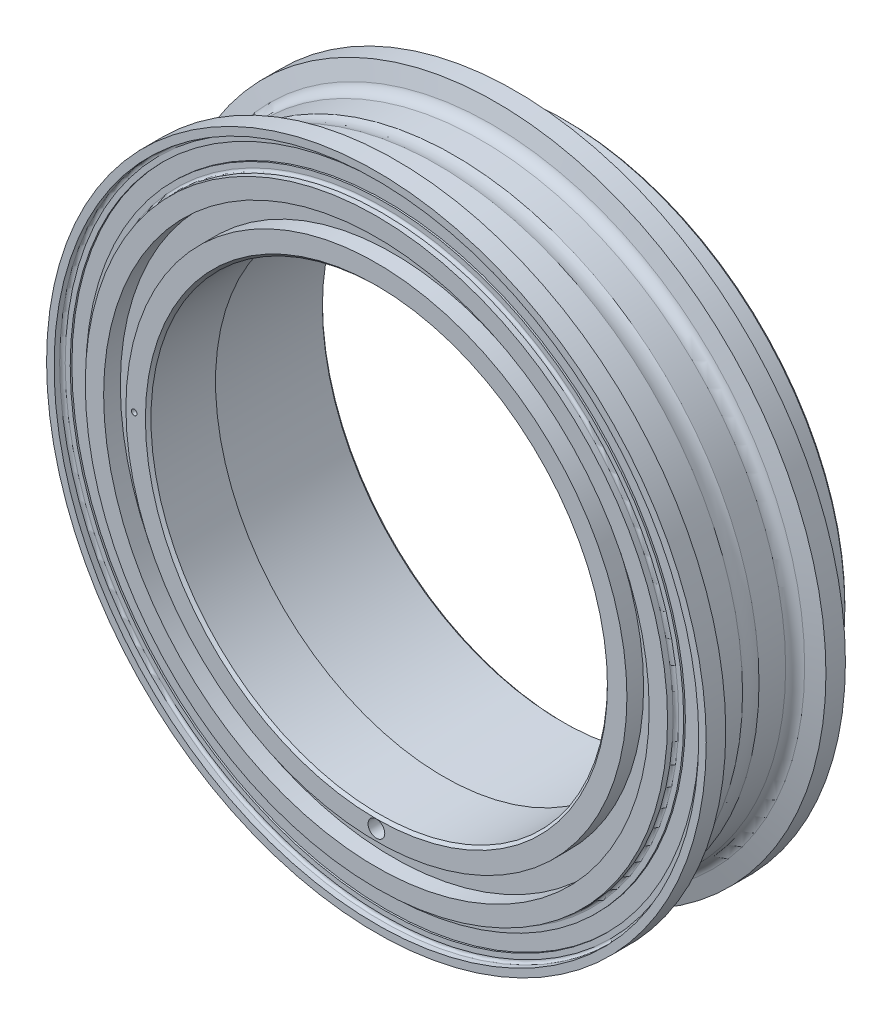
ISO-10303-21;
HEADER;
FILE_DESCRIPTION(('STEP AP214'),'2;1');
FILE_NAME('part.step','',(''),(''),'','','');
FILE_SCHEMA(('AUTOMOTIVE_DESIGN { 1 0 10303 214 1 1 1 1 }'));
ENDSEC;
DATA;
#1=APPLICATION_CONTEXT('core data for automotive mechanical design processes');
#2=APPLICATION_PROTOCOL_DEFINITION('international standard','automotive_design',2000,#1);
#3=PRODUCT_CONTEXT('',#1,'mechanical');
#4=PRODUCT('Part','Part','',(#3));
#5=PRODUCT_RELATED_PRODUCT_CATEGORY('part','',(#4));
#6=PRODUCT_DEFINITION_FORMATION('','',#4);
#7=PRODUCT_DEFINITION_CONTEXT('part definition',#1,'design');
#8=PRODUCT_DEFINITION('design','',#6,#7);
#9=PRODUCT_DEFINITION_SHAPE('','',#8);
#10=(LENGTH_UNIT() NAMED_UNIT(*) SI_UNIT(.MILLI.,.METRE.));
#11=(NAMED_UNIT(*) PLANE_ANGLE_UNIT() SI_UNIT($,.RADIAN.));
#12=(NAMED_UNIT(*) SI_UNIT($,.STERADIAN.) SOLID_ANGLE_UNIT());
#13=UNCERTAINTY_MEASURE_WITH_UNIT(LENGTH_MEASURE(1.E-05),#10,'distance_accuracy_value','');
#14=(GEOMETRIC_REPRESENTATION_CONTEXT(3) GLOBAL_UNCERTAINTY_ASSIGNED_CONTEXT((#13)) GLOBAL_UNIT_ASSIGNED_CONTEXT((#10,
#11,#12)) REPRESENTATION_CONTEXT('',''));
#15=CARTESIAN_POINT('',(0.,0.,0.));
#16=DIRECTION('',(0.,0.,1.));
#17=DIRECTION('',(1.,0.,0.));
#18=AXIS2_PLACEMENT_3D('',#15,#16,#17);
#19=CARTESIAN_POINT('',(-43.5,0.,-4.51545182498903));
#20=DIRECTION('',(0.,0.,1.));
#21=DIRECTION('',(1.,0.,0.));
#22=AXIS2_PLACEMENT_3D('',#19,#20,#21);
#23=CYLINDRICAL_SURFACE('',#22,0.5);
#24=CARTESIAN_POINT('',(-43.5,0.,-4.));
#25=DIRECTION('',(0.,0.,1.));
#26=DIRECTION('',(1.,0.,0.));
#27=AXIS2_PLACEMENT_3D('',#24,#25,#26);
#28=CIRCLE('',#27,0.5);
#29=CARTESIAN_POINT('',(-43.,0.,-4.));
#30=VERTEX_POINT('',#29);
#31=EDGE_CURVE('E207',#30,#30,#28,.T.);
#32=ORIENTED_EDGE('',*,*,#31,.F.);
#33=EDGE_LOOP('',(#32));
#34=FACE_BOUND('',#33,.T.);
#35=CARTESIAN_POINT('',(-43.5,0.,0.));
#36=DIRECTION('',(0.,0.,1.));
#37=DIRECTION('',(1.,0.,0.));
#38=AXIS2_PLACEMENT_3D('',#35,#36,#37);
#39=CIRCLE('',#38,0.5);
#40=CARTESIAN_POINT('',(-43.,0.,0.));
#41=VERTEX_POINT('',#40);
#42=EDGE_CURVE('E20',#41,#41,#39,.T.);
#43=ORIENTED_EDGE('',*,*,#42,.T.);
#44=EDGE_LOOP('',(#43));
#45=FACE_BOUND('',#44,.T.);
#46=ADVANCED_FACE('F16',(#34,#45),#23,.F.);
#47=CARTESIAN_POINT('',(-43.5,0.,-3.99999999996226));
#48=DIRECTION('',(0.,0.,1.));
#49=DIRECTION('',(1.,0.,0.));
#50=AXIS2_PLACEMENT_3D('',#47,#48,#49);
#51=CONICAL_SURFACE('',#50,0.500000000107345,1.02974425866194);
#52=CARTESIAN_POINT('',(-43.4999999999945,0.,-4.3004303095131));
#53=VERTEX_POINT('',#52);
#54=VERTEX_LOOP('',#53);
#55=FACE_BOUND('',#54,.T.);
#56=ORIENTED_EDGE('',*,*,#31,.T.);
#57=EDGE_LOOP('',(#56));
#58=FACE_BOUND('',#57,.T.);
#59=ADVANCED_FACE('F18',(#55,#58),#51,.F.);
#60=CARTESIAN_POINT('',(0.,-43.,-6.196355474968));
#61=DIRECTION('',(0.,0.,1.));
#62=DIRECTION('',(1.,0.,0.));
#63=AXIS2_PLACEMENT_3D('',#60,#61,#62);
#64=CYLINDRICAL_SURFACE('',#63,1.5);
#65=CARTESIAN_POINT('',(0.,-43.,-5.));
#66=DIRECTION('',(0.,0.,1.));
#67=DIRECTION('',(1.,0.,0.));
#68=AXIS2_PLACEMENT_3D('',#65,#66,#67);
#69=CIRCLE('',#68,1.5);
#70=CARTESIAN_POINT('',(1.49999999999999,-43.,-5.));
#71=VERTEX_POINT('',#70);
#72=EDGE_CURVE('E203',#71,#71,#69,.T.);
#73=ORIENTED_EDGE('',*,*,#72,.F.);
#74=EDGE_LOOP('',(#73));
#75=FACE_BOUND('',#74,.T.);
#76=CARTESIAN_POINT('',(0.,-43.,0.));
#77=DIRECTION('',(0.,0.,1.));
#78=DIRECTION('',(1.,0.,0.));
#79=AXIS2_PLACEMENT_3D('',#76,#77,#78);
#80=CIRCLE('',#79,1.5);
#81=CARTESIAN_POINT('',(0.,-41.5,0.));
#82=VERTEX_POINT('',#81);
#83=EDGE_CURVE('E25',#82,#82,#80,.T.);
#84=ORIENTED_EDGE('',*,*,#83,.T.);
#85=EDGE_LOOP('',(#84));
#86=FACE_BOUND('',#85,.T.);
#87=ADVANCED_FACE('F219',(#75,#86),#64,.F.);
#88=CARTESIAN_POINT('',(0.,-43.,-4.99999999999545));
#89=DIRECTION('',(0.,0.,1.));
#90=DIRECTION('',(1.,0.,0.));
#91=AXIS2_PLACEMENT_3D('',#88,#89,#90);
#92=CONICAL_SURFACE('',#91,1.4999999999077,1.02974425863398);
#93=CARTESIAN_POINT('',(0.,-43.,-5.90129092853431));
#94=VERTEX_POINT('',#93);
#95=VERTEX_LOOP('',#94);
#96=FACE_BOUND('',#95,.T.);
#97=ORIENTED_EDGE('',*,*,#72,.T.);
#98=EDGE_LOOP('',(#97));
#99=FACE_BOUND('',#98,.T.);
#100=ADVANCED_FACE('F238',(#96,#99),#92,.F.);
#101=CARTESIAN_POINT('',(0.,0.,0.));
#102=DIRECTION('',(0.,0.,1.));
#103=DIRECTION('',(1.,0.,0.));
#104=AXIS2_PLACEMENT_3D('',#101,#102,#103);
#105=CONICAL_SURFACE('',#104,41.5,0.785398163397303);
#106=CARTESIAN_POINT('',(0.,0.,0.));
#107=DIRECTION('',(0.,0.,1.));
#108=DIRECTION('',(1.,0.,0.));
#109=AXIS2_PLACEMENT_3D('',#106,#107,#108);
#110=CIRCLE('',#109,41.5);
#111=EDGE_CURVE('E211',#82,#82,#110,.T.);
#112=ORIENTED_EDGE('',*,*,#111,.T.);
#113=EDGE_LOOP('',(#112));
#114=FACE_BOUND('',#113,.T.);
#115=CARTESIAN_POINT('',(0.,0.,-0.500000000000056));
#116=DIRECTION('',(0.,0.,1.));
#117=DIRECTION('',(1.,0.,0.));
#118=AXIS2_PLACEMENT_3D('',#115,#116,#117);
#119=CIRCLE('',#118,41.);
#120=CARTESIAN_POINT('',(41.,0.,-0.500000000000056));
#121=VERTEX_POINT('',#120);
#122=EDGE_CURVE('E206',#121,#121,#119,.F.);
#123=ORIENTED_EDGE('',*,*,#122,.T.);
#124=EDGE_LOOP('',(#123));
#125=FACE_BOUND('',#124,.T.);
#126=ADVANCED_FACE('F214',(#114,#125),#105,.F.);
#127=CARTESIAN_POINT('',(0.,0.,-35.595));
#128=DIRECTION('',(0.,0.,1.));
#129=DIRECTION('',(1.,0.,0.));
#130=AXIS2_PLACEMENT_3D('',#127,#128,#129);
#131=CYLINDRICAL_SURFACE('',#130,41.);
#132=ORIENTED_EDGE('',*,*,#122,.F.);
#133=EDGE_LOOP('',(#132));
#134=FACE_BOUND('',#133,.T.);
#135=CARTESIAN_POINT('',(0.,0.,-12.1));
#136=DIRECTION('',(0.,0.,1.));
#137=DIRECTION('',(1.,0.,0.));
#138=AXIS2_PLACEMENT_3D('',#135,#136,#137);
#139=CIRCLE('',#138,41.);
#140=CARTESIAN_POINT('',(41.,0.,-12.1));
#141=VERTEX_POINT('',#140);
#142=EDGE_CURVE('E536',#141,#141,#139,.F.);
#143=ORIENTED_EDGE('',*,*,#142,.T.);
#144=EDGE_LOOP('',(#143));
#145=FACE_BOUND('',#144,.T.);
#146=ADVANCED_FACE('F237',(#134,#145),#131,.F.);
#147=CARTESIAN_POINT('',(0.,0.,-12.1));
#148=DIRECTION('',(0.,0.,1.));
#149=DIRECTION('',(1.,0.,0.));
#150=AXIS2_PLACEMENT_3D('',#147,#148,#149);
#151=PLANE('',#150);
#152=CARTESIAN_POINT('',(0.,0.,-12.1));
#153=DIRECTION('',(0.,0.,1.));
#154=DIRECTION('',(1.,0.,0.));
#155=AXIS2_PLACEMENT_3D('',#152,#153,#154);
#156=CIRCLE('',#155,43.1);
#157=CARTESIAN_POINT('',(43.1,0.,-12.1));
#158=VERTEX_POINT('',#157);
#159=EDGE_CURVE('E539',#158,#158,#156,.F.);
#160=ORIENTED_EDGE('',*,*,#159,.T.);
#161=EDGE_LOOP('',(#160));
#162=FACE_BOUND('',#161,.T.);
#163=ORIENTED_EDGE('',*,*,#142,.F.);
#164=EDGE_LOOP('',(#163));
#165=FACE_BOUND('',#164,.T.);
#166=ADVANCED_FACE('F241',(#162,#165),#151,.F.);
#167=CARTESIAN_POINT('',(0.,0.,-35.595));
#168=DIRECTION('',(0.,0.,1.));
#169=DIRECTION('',(1.,0.,0.));
#170=AXIS2_PLACEMENT_3D('',#167,#168,#169);
#171=CYLINDRICAL_SURFACE('',#170,43.1);
#172=CARTESIAN_POINT('',(0.,0.,-33.4));
#173=DIRECTION('',(0.,0.,1.));
#174=DIRECTION('',(1.,0.,0.));
#175=AXIS2_PLACEMENT_3D('',#172,#173,#174);
#176=CIRCLE('',#175,43.1);
#177=CARTESIAN_POINT('',(43.1,0.,-33.4));
#178=VERTEX_POINT('',#177);
#179=EDGE_CURVE('E542',#178,#178,#176,.T.);
#180=ORIENTED_EDGE('',*,*,#179,.F.);
#181=EDGE_LOOP('',(#180));
#182=FACE_BOUND('',#181,.T.);
#183=ORIENTED_EDGE('',*,*,#159,.F.);
#184=EDGE_LOOP('',(#183));
#185=FACE_BOUND('',#184,.T.);
#186=ADVANCED_FACE('F245',(#182,#185),#171,.F.);
#187=CARTESIAN_POINT('',(0.,0.,-33.9));
#188=DIRECTION('',(0.,0.,-1.));
#189=DIRECTION('',(-1.,0.,0.));
#190=AXIS2_PLACEMENT_3D('',#187,#188,#189);
#191=CONICAL_SURFACE('',#190,43.6,0.785398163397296);
#192=ORIENTED_EDGE('',*,*,#179,.T.);
#193=EDGE_LOOP('',(#192));
#194=FACE_BOUND('',#193,.T.);
#195=CARTESIAN_POINT('',(0.,0.,-33.9));
#196=DIRECTION('',(0.,0.,-1.));
#197=DIRECTION('',(-1.,0.,0.));
#198=AXIS2_PLACEMENT_3D('',#195,#196,#197);
#199=CIRCLE('',#198,43.6);
#200=CARTESIAN_POINT('',(-43.6,0.,-33.9));
#201=VERTEX_POINT('',#200);
#202=EDGE_CURVE('E545',#201,#201,#199,.F.);
#203=ORIENTED_EDGE('',*,*,#202,.F.);
#204=EDGE_LOOP('',(#203));
#205=FACE_BOUND('',#204,.T.);
#206=ADVANCED_FACE('F249',(#194,#205),#191,.F.);
#207=CARTESIAN_POINT('',(0.,0.,-33.9));
#208=DIRECTION('',(0.,0.,1.));
#209=DIRECTION('',(1.,0.,0.));
#210=AXIS2_PLACEMENT_3D('',#207,#208,#209);
#211=PLANE('',#210);
#212=CARTESIAN_POINT('',(0.,0.,-33.9));
#213=DIRECTION('',(0.,0.,1.));
#214=DIRECTION('',(1.,0.,0.));
#215=AXIS2_PLACEMENT_3D('',#212,#213,#214);
#216=CIRCLE('',#215,50.2500000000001);
#217=CARTESIAN_POINT('',(50.2500000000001,0.,-33.9));
#218=VERTEX_POINT('',#217);
#219=EDGE_CURVE('E548',#218,#218,#216,.T.);
#220=ORIENTED_EDGE('',*,*,#219,.F.);
#221=EDGE_LOOP('',(#220));
#222=FACE_BOUND('',#221,.T.);
#223=CARTESIAN_POINT('',(0.,-47.,-33.9));
#224=DIRECTION('',(0.,0.,-1.));
#225=DIRECTION('',(-1.,0.,0.));
#226=AXIS2_PLACEMENT_3D('',#223,#224,#225);
#227=CIRCLE('',#226,2.1);
#228=CARTESIAN_POINT('',(-2.1,-47.,-33.9));
#229=VERTEX_POINT('',#228);
#230=EDGE_CURVE('E551',#229,#229,#227,.T.);
#231=ORIENTED_EDGE('',*,*,#230,.F.);
#232=EDGE_LOOP('',(#231));
#233=FACE_BOUND('',#232,.T.);
#234=CARTESIAN_POINT('',(-47.,0.,-33.9));
#235=DIRECTION('',(0.,0.,-1.));
#236=DIRECTION('',(-1.,0.,0.));
#237=AXIS2_PLACEMENT_3D('',#234,#235,#236);
#238=CIRCLE('',#237,2.1);
#239=CARTESIAN_POINT('',(-49.1,0.,-33.9));
#240=VERTEX_POINT('',#239);
#241=EDGE_CURVE('E554',#240,#240,#238,.T.);
#242=ORIENTED_EDGE('',*,*,#241,.F.);
#243=EDGE_LOOP('',(#242));
#244=FACE_BOUND('',#243,.T.);
#245=CARTESIAN_POINT('',(0.,47.,-33.9));
#246=DIRECTION('',(0.,0.,-1.));
#247=DIRECTION('',(-1.,0.,0.));
#248=AXIS2_PLACEMENT_3D('',#245,#246,#247);
#249=CIRCLE('',#248,2.1);
#250=CARTESIAN_POINT('',(-2.1,47.,-33.9));
#251=VERTEX_POINT('',#250);
#252=EDGE_CURVE('E557',#251,#251,#249,.T.);
#253=ORIENTED_EDGE('',*,*,#252,.F.);
#254=EDGE_LOOP('',(#253));
#255=FACE_BOUND('',#254,.T.);
#256=ORIENTED_EDGE('',*,*,#202,.T.);
#257=EDGE_LOOP('',(#256));
#258=FACE_BOUND('',#257,.T.);
#259=CARTESIAN_POINT('',(47.,0.,-33.9));
#260=DIRECTION('',(0.,0.,-1.));
#261=DIRECTION('',(-1.,0.,0.));
#262=AXIS2_PLACEMENT_3D('',#259,#260,#261);
#263=CIRCLE('',#262,2.1);
#264=CARTESIAN_POINT('',(44.9,0.,-33.9));
#265=VERTEX_POINT('',#264);
#266=EDGE_CURVE('E96',#265,#265,#263,.T.);
#267=ORIENTED_EDGE('',*,*,#266,.F.);
#268=EDGE_LOOP('',(#267));
#269=FACE_BOUND('',#268,.T.);
#270=ADVANCED_FACE('F253',(#222,#233,#244,#255,#258,#269),#211,.F.);
#271=CARTESIAN_POINT('',(0.,0.,-33.4));
#272=DIRECTION('',(0.,0.,1.));
#273=DIRECTION('',(1.,0.,0.));
#274=AXIS2_PLACEMENT_3D('',#271,#272,#273);
#275=CONICAL_SURFACE('',#274,50.75,0.785398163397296);
#276=CARTESIAN_POINT('',(0.,0.,-33.4));
#277=DIRECTION('',(0.,0.,1.));
#278=DIRECTION('',(1.,0.,0.));
#279=AXIS2_PLACEMENT_3D('',#276,#277,#278);
#280=CIRCLE('',#279,50.75);
#281=CARTESIAN_POINT('',(50.75,0.,-33.4));
#282=VERTEX_POINT('',#281);
#283=EDGE_CURVE('E90',#282,#282,#280,.F.);
#284=ORIENTED_EDGE('',*,*,#283,.T.);
#285=EDGE_LOOP('',(#284));
#286=FACE_BOUND('',#285,.T.);
#287=ORIENTED_EDGE('',*,*,#219,.T.);
#288=EDGE_LOOP('',(#287));
#289=FACE_BOUND('',#288,.T.);
#290=ADVANCED_FACE('F257',(#286,#289),#275,.T.);
#291=CARTESIAN_POINT('',(0.,-47.,-19.97510233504));
#292=DIRECTION('',(0.,0.,-1.));
#293=DIRECTION('',(-1.,0.,0.));
#294=AXIS2_PLACEMENT_3D('',#291,#292,#293);
#295=CYLINDRICAL_SURFACE('',#294,2.1);
#296=CARTESIAN_POINT('',(0.,-47.,-21.9));
#297=DIRECTION('',(0.,0.,-1.));
#298=DIRECTION('',(-1.,0.,0.));
#299=AXIS2_PLACEMENT_3D('',#296,#297,#298);
#300=CIRCLE('',#299,2.1);
#301=CARTESIAN_POINT('',(-2.1,-47.,-21.9));
#302=VERTEX_POINT('',#301);
#303=EDGE_CURVE('E87',#302,#302,#300,.T.);
#304=ORIENTED_EDGE('',*,*,#303,.F.);
#305=EDGE_LOOP('',(#304));
#306=FACE_BOUND('',#305,.T.);
#307=ORIENTED_EDGE('',*,*,#230,.T.);
#308=EDGE_LOOP('',(#307));
#309=FACE_BOUND('',#308,.T.);
#310=ADVANCED_FACE('F261',(#306,#309),#295,.F.);
#311=CARTESIAN_POINT('',(-47.,0.,-19.97510233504));
#312=DIRECTION('',(0.,0.,-1.));
#313=DIRECTION('',(-1.,0.,0.));
#314=AXIS2_PLACEMENT_3D('',#311,#312,#313);
#315=CYLINDRICAL_SURFACE('',#314,2.1);
#316=CARTESIAN_POINT('',(-47.,0.,-21.9));
#317=DIRECTION('',(0.,0.,-1.));
#318=DIRECTION('',(-1.,0.,0.));
#319=AXIS2_PLACEMENT_3D('',#316,#317,#318);
#320=CIRCLE('',#319,2.1);
#321=CARTESIAN_POINT('',(-49.1,0.,-21.9));
#322=VERTEX_POINT('',#321);
#323=EDGE_CURVE('E89',#322,#322,#320,.T.);
#324=ORIENTED_EDGE('',*,*,#323,.F.);
#325=EDGE_LOOP('',(#324));
#326=FACE_BOUND('',#325,.T.);
#327=ORIENTED_EDGE('',*,*,#241,.T.);
#328=EDGE_LOOP('',(#327));
#329=FACE_BOUND('',#328,.T.);
#330=ADVANCED_FACE('F265',(#326,#329),#315,.F.);
#331=CARTESIAN_POINT('',(0.,47.,-19.97510233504));
#332=DIRECTION('',(0.,0.,-1.));
#333=DIRECTION('',(-1.,0.,0.));
#334=AXIS2_PLACEMENT_3D('',#331,#332,#333);
#335=CYLINDRICAL_SURFACE('',#334,2.1);
#336=CARTESIAN_POINT('',(0.,47.,-21.9));
#337=DIRECTION('',(0.,0.,-1.));
#338=DIRECTION('',(-1.,0.,0.));
#339=AXIS2_PLACEMENT_3D('',#336,#337,#338);
#340=CIRCLE('',#339,2.1);
#341=CARTESIAN_POINT('',(-2.1,47.,-21.9));
#342=VERTEX_POINT('',#341);
#343=EDGE_CURVE('E93',#342,#342,#340,.T.);
#344=ORIENTED_EDGE('',*,*,#343,.F.);
#345=EDGE_LOOP('',(#344));
#346=FACE_BOUND('',#345,.T.);
#347=ORIENTED_EDGE('',*,*,#252,.T.);
#348=EDGE_LOOP('',(#347));
#349=FACE_BOUND('',#348,.T.);
#350=ADVANCED_FACE('F268',(#346,#349),#335,.F.);
#351=CARTESIAN_POINT('',(47.,0.,-19.97510233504));
#352=DIRECTION('',(0.,0.,-1.));
#353=DIRECTION('',(-1.,0.,0.));
#354=AXIS2_PLACEMENT_3D('',#351,#352,#353);
#355=CYLINDRICAL_SURFACE('',#354,2.1);
#356=CARTESIAN_POINT('',(47.,0.,-21.9));
#357=DIRECTION('',(0.,0.,-1.));
#358=DIRECTION('',(-1.,0.,0.));
#359=AXIS2_PLACEMENT_3D('',#356,#357,#358);
#360=CIRCLE('',#359,2.1);
#361=CARTESIAN_POINT('',(44.9,0.,-21.9));
#362=VERTEX_POINT('',#361);
#363=EDGE_CURVE('E102',#362,#362,#360,.T.);
#364=ORIENTED_EDGE('',*,*,#363,.F.);
#365=EDGE_LOOP('',(#364));
#366=FACE_BOUND('',#365,.T.);
#367=ORIENTED_EDGE('',*,*,#266,.T.);
#368=EDGE_LOOP('',(#367));
#369=FACE_BOUND('',#368,.T.);
#370=ADVANCED_FACE('F272',(#366,#369),#355,.F.);
#371=CARTESIAN_POINT('',(0.,0.,-35.595));
#372=DIRECTION('',(0.,0.,1.));
#373=DIRECTION('',(1.,0.,0.));
#374=AXIS2_PLACEMENT_3D('',#371,#372,#373);
#375=CYLINDRICAL_SURFACE('',#374,50.75);
#376=CARTESIAN_POINT('',(0.,0.,-25.));
#377=DIRECTION('',(0.,0.,1.));
#378=DIRECTION('',(1.,0.,0.));
#379=AXIS2_PLACEMENT_3D('',#376,#377,#378);
#380=CIRCLE('',#379,50.75);
#381=CARTESIAN_POINT('',(50.75,0.,-25.));
#382=VERTEX_POINT('',#381);
#383=EDGE_CURVE('E105',#382,#382,#380,.F.);
#384=ORIENTED_EDGE('',*,*,#383,.T.);
#385=EDGE_LOOP('',(#384));
#386=FACE_BOUND('',#385,.T.);
#387=ORIENTED_EDGE('',*,*,#283,.F.);
#388=EDGE_LOOP('',(#387));
#389=FACE_BOUND('',#388,.T.);
#390=ADVANCED_FACE('F83',(#386,#389),#375,.T.);
#391=CARTESIAN_POINT('',(0.,-47.,-21.8999999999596));
#392=DIRECTION('',(0.,0.,-1.));
#393=DIRECTION('',(-1.,0.,0.));
#394=AXIS2_PLACEMENT_3D('',#391,#392,#393);
#395=CONICAL_SURFACE('',#394,2.09999999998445,1.02974425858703);
#396=CARTESIAN_POINT('',(-1.98951966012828E-10,-47.,-20.6381926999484));
#397=VERTEX_POINT('',#396);
#398=VERTEX_LOOP('',#397);
#399=FACE_BOUND('',#398,.T.);
#400=ORIENTED_EDGE('',*,*,#303,.T.);
#401=EDGE_LOOP('',(#400));
#402=FACE_BOUND('',#401,.T.);
#403=ADVANCED_FACE('F79',(#399,#402),#395,.F.);
#404=CARTESIAN_POINT('',(-47.,0.,-21.9000000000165));
#405=DIRECTION('',(0.,0.,-1.));
#406=DIRECTION('',(-1.,0.,0.));
#407=AXIS2_PLACEMENT_3D('',#404,#405,#406);
#408=CONICAL_SURFACE('',#407,2.10000000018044,1.02974425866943);
#409=CARTESIAN_POINT('',(-47.0000000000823,0.,-20.6381926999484));
#410=VERTEX_POINT('',#409);
#411=VERTEX_LOOP('',#410);
#412=FACE_BOUND('',#411,.T.);
#413=ORIENTED_EDGE('',*,*,#323,.T.);
#414=EDGE_LOOP('',(#413));
#415=FACE_BOUND('',#414,.T.);
#416=ADVANCED_FACE('F82',(#412,#415),#408,.F.);
#417=CARTESIAN_POINT('',(0.,47.,-21.8999999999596));
#418=DIRECTION('',(0.,0.,-1.));
#419=DIRECTION('',(-1.,0.,0.));
#420=AXIS2_PLACEMENT_3D('',#417,#418,#419);
#421=CONICAL_SURFACE('',#420,2.09999999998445,1.02974425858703);
#422=CARTESIAN_POINT('',(5.68441778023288E-11,47.,-20.63819269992));
#423=VERTEX_POINT('',#422);
#424=VERTEX_LOOP('',#423);
#425=FACE_BOUND('',#424,.T.);
#426=ORIENTED_EDGE('',*,*,#343,.T.);
#427=EDGE_LOOP('',(#426));
#428=FACE_BOUND('',#427,.T.);
#429=ADVANCED_FACE('F282',(#425,#428),#421,.F.);
#430=CARTESIAN_POINT('',(47.,0.,-21.8999999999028));
#431=DIRECTION('',(0.,0.,-1.));
#432=DIRECTION('',(-1.,0.,0.));
#433=AXIS2_PLACEMENT_3D('',#430,#431,#432);
#434=CONICAL_SURFACE('',#433,2.099999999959,1.02974425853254);
#435=CARTESIAN_POINT('',(46.9999999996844,0.,-20.6381926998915));
#436=VERTEX_POINT('',#435);
#437=VERTEX_LOOP('',#436);
#438=FACE_BOUND('',#437,.T.);
#439=ORIENTED_EDGE('',*,*,#363,.T.);
#440=EDGE_LOOP('',(#439));
#441=FACE_BOUND('',#440,.T.);
#442=ADVANCED_FACE('F286',(#438,#441),#434,.F.);
#443=CARTESIAN_POINT('',(0.,0.,-25.));
#444=DIRECTION('',(0.,0.,1.));
#445=DIRECTION('',(1.,0.,0.));
#446=AXIS2_PLACEMENT_3D('',#443,#444,#445);
#447=PLANE('',#446);
#448=CARTESIAN_POINT('',(0.,0.,-25.));
#449=DIRECTION('',(0.,0.,1.));
#450=DIRECTION('',(1.,0.,0.));
#451=AXIS2_PLACEMENT_3D('',#448,#449,#450);
#452=CIRCLE('',#451,52.3);
#453=CARTESIAN_POINT('',(52.3,0.,-25.));
#454=VERTEX_POINT('',#453);
#455=EDGE_CURVE('E108',#454,#454,#452,.T.);
#456=ORIENTED_EDGE('',*,*,#455,.F.);
#457=EDGE_LOOP('',(#456));
#458=FACE_BOUND('',#457,.T.);
#459=ORIENTED_EDGE('',*,*,#383,.F.);
#460=EDGE_LOOP('',(#459));
#461=FACE_BOUND('',#460,.T.);
#462=ADVANCED_FACE('F290',(#458,#461),#447,.F.);
#463=CARTESIAN_POINT('',(0.,0.,-35.595));
#464=DIRECTION('',(0.,0.,1.));
#465=DIRECTION('',(1.,0.,0.));
#466=AXIS2_PLACEMENT_3D('',#463,#464,#465);
#467=CYLINDRICAL_SURFACE('',#466,52.3);
#468=CARTESIAN_POINT('',(0.,0.,-24.));
#469=DIRECTION('',(0.,0.,1.));
#470=DIRECTION('',(1.,0.,0.));
#471=AXIS2_PLACEMENT_3D('',#468,#469,#470);
#472=CIRCLE('',#471,52.3);
#473=CARTESIAN_POINT('',(52.3,0.,-24.));
#474=VERTEX_POINT('',#473);
#475=EDGE_CURVE('E111',#474,#474,#472,.F.);
#476=ORIENTED_EDGE('',*,*,#475,.T.);
#477=EDGE_LOOP('',(#476));
#478=FACE_BOUND('',#477,.T.);
#479=ORIENTED_EDGE('',*,*,#455,.T.);
#480=EDGE_LOOP('',(#479));
#481=FACE_BOUND('',#480,.T.);
#482=ADVANCED_FACE('F294',(#478,#481),#467,.T.);
#483=CARTESIAN_POINT('',(0.,0.,-24.));
#484=DIRECTION('',(0.,0.,1.));
#485=DIRECTION('',(-1.,0.,0.));
#486=AXIS2_PLACEMENT_3D('',#483,#484,#485);
#487=TOROIDAL_SURFACE('',#486,52.8,0.5);
#488=ORIENTED_EDGE('',*,*,#475,.F.);
#489=EDGE_LOOP('',(#488));
#490=FACE_BOUND('',#489,.T.);
#491=CARTESIAN_POINT('',(0.,0.,-23.5));
#492=DIRECTION('',(0.,0.,-1.));
#493=DIRECTION('',(1.,0.,0.));
#494=AXIS2_PLACEMENT_3D('',#491,#492,#493);
#495=CIRCLE('',#494,52.8);
#496=CARTESIAN_POINT('',(-52.8,0.,-23.5));
#497=VERTEX_POINT('',#496);
#498=CARTESIAN_POINT('',(52.8,0.,-23.5));
#499=VERTEX_POINT('',#498);
#500=EDGE_CURVE('E114',#497,#499,#495,.F.);
#501=ORIENTED_EDGE('',*,*,#500,.F.);
#502=CARTESIAN_POINT('',(0.,0.,-23.5));
#503=DIRECTION('',(0.,0.,-1.));
#504=DIRECTION('',(-1.,0.,0.));
#505=AXIS2_PLACEMENT_3D('',#502,#503,#504);
#506=CIRCLE('',#505,52.8);
#507=EDGE_CURVE('E119',#499,#497,#506,.F.);
#508=ORIENTED_EDGE('',*,*,#507,.F.);
#509=EDGE_LOOP('',(#501,#508));
#510=FACE_BOUND('',#509,.T.);
#511=ADVANCED_FACE('F298',(#490,#510),#487,.F.);
#512=CARTESIAN_POINT('',(0.,0.,-23.5));
#513=DIRECTION('',(0.,0.,1.));
#514=DIRECTION('',(1.,0.,0.));
#515=AXIS2_PLACEMENT_3D('',#512,#513,#514);
#516=PLANE('',#515);
#517=CARTESIAN_POINT('',(0.,0.,-23.5));
#518=DIRECTION('',(0.,0.,1.));
#519=DIRECTION('',(1.,0.,0.));
#520=AXIS2_PLACEMENT_3D('',#517,#518,#519);
#521=CIRCLE('',#520,53.7);
#522=CARTESIAN_POINT('',(53.7,0.,-23.5));
#523=VERTEX_POINT('',#522);
#524=EDGE_CURVE('E115',#523,#523,#521,.T.);
#525=ORIENTED_EDGE('',*,*,#524,.F.);
#526=EDGE_LOOP('',(#525));
#527=FACE_BOUND('',#526,.T.);
#528=ORIENTED_EDGE('',*,*,#500,.T.);
#529=ORIENTED_EDGE('',*,*,#507,.T.);
#530=EDGE_LOOP('',(#528,#529));
#531=FACE_BOUND('',#530,.T.);
#532=ADVANCED_FACE('F304',(#527,#531),#516,.F.);
#533=CARTESIAN_POINT('',(0.,0.,-35.595));
#534=DIRECTION('',(0.,0.,1.));
#535=DIRECTION('',(1.,0.,0.));
#536=AXIS2_PLACEMENT_3D('',#533,#534,#535);
#537=CYLINDRICAL_SURFACE('',#536,53.7);
#538=CARTESIAN_POINT('',(0.,0.,-23.2));
#539=DIRECTION('',(0.,0.,1.));
#540=DIRECTION('',(1.,0.,0.));
#541=AXIS2_PLACEMENT_3D('',#538,#539,#540);
#542=CIRCLE('',#541,53.7);
#543=CARTESIAN_POINT('',(53.7,0.,-23.2));
#544=VERTEX_POINT('',#543);
#545=EDGE_CURVE('E118',#544,#544,#542,.F.);
#546=ORIENTED_EDGE('',*,*,#545,.T.);
#547=EDGE_LOOP('',(#546));
#548=FACE_BOUND('',#547,.T.);
#549=ORIENTED_EDGE('',*,*,#524,.T.);
#550=EDGE_LOOP('',(#549));
#551=FACE_BOUND('',#550,.T.);
#552=ADVANCED_FACE('F714',(#548,#551),#537,.T.);
#553=CARTESIAN_POINT('',(0.,0.,-23.2));
#554=DIRECTION('',(0.,0.,1.));
#555=DIRECTION('',(1.,0.,0.));
#556=AXIS2_PLACEMENT_3D('',#553,#554,#555);
#557=PLANE('',#556);
#558=CARTESIAN_POINT('',(0.,0.,-23.2));
#559=DIRECTION('',(0.,0.,1.));
#560=DIRECTION('',(1.,0.,0.));
#561=AXIS2_PLACEMENT_3D('',#558,#559,#560);
#562=CIRCLE('',#561,56.5);
#563=CARTESIAN_POINT('',(56.5,0.,-23.2));
#564=VERTEX_POINT('',#563);
#565=EDGE_CURVE('E122',#564,#564,#562,.T.);
#566=ORIENTED_EDGE('',*,*,#565,.F.);
#567=EDGE_LOOP('',(#566));
#568=FACE_BOUND('',#567,.T.);
#569=ORIENTED_EDGE('',*,*,#545,.F.);
#570=EDGE_LOOP('',(#569));
#571=FACE_BOUND('',#570,.T.);
#572=ADVANCED_FACE('F722',(#568,#571),#557,.F.);
#573=CARTESIAN_POINT('',(0.,0.,-35.595));
#574=DIRECTION('',(0.,0.,1.));
#575=DIRECTION('',(1.,0.,0.));
#576=AXIS2_PLACEMENT_3D('',#573,#574,#575);
#577=CYLINDRICAL_SURFACE('',#576,56.5);
#578=CARTESIAN_POINT('',(0.,0.,-23.5));
#579=DIRECTION('',(0.,0.,1.));
#580=DIRECTION('',(1.,0.,0.));
#581=AXIS2_PLACEMENT_3D('',#578,#579,#580);
#582=CIRCLE('',#581,56.5);
#583=CARTESIAN_POINT('',(56.5,0.,-23.5));
#584=VERTEX_POINT('',#583);
#585=EDGE_CURVE('E125',#584,#584,#582,.T.);
#586=ORIENTED_EDGE('',*,*,#585,.F.);
#587=EDGE_LOOP('',(#586));
#588=FACE_BOUND('',#587,.T.);
#589=ORIENTED_EDGE('',*,*,#565,.T.);
#590=EDGE_LOOP('',(#589));
#591=FACE_BOUND('',#590,.T.);
#592=ADVANCED_FACE('F371',(#588,#591),#577,.F.);
#593=CARTESIAN_POINT('',(0.,0.,-23.5));
#594=DIRECTION('',(0.,0.,1.));
#595=DIRECTION('',(1.,0.,0.));
#596=AXIS2_PLACEMENT_3D('',#593,#594,#595);
#597=PLANE('',#596);
#598=CARTESIAN_POINT('',(0.,0.,-23.5));
#599=DIRECTION('',(0.,0.,1.));
#600=DIRECTION('',(1.,0.,0.));
#601=AXIS2_PLACEMENT_3D('',#598,#599,#600);
#602=CIRCLE('',#601,57.4);
#603=CARTESIAN_POINT('',(57.4,0.,-23.5));
#604=VERTEX_POINT('',#603);
#605=CARTESIAN_POINT('',(-57.4,0.,-23.5));
#606=VERTEX_POINT('',#605);
#607=EDGE_CURVE('E128',#604,#606,#602,.T.);
#608=ORIENTED_EDGE('',*,*,#607,.F.);
#609=CARTESIAN_POINT('',(0.,0.,-23.5));
#610=DIRECTION('',(0.,0.,1.));
#611=DIRECTION('',(-1.,0.,0.));
#612=AXIS2_PLACEMENT_3D('',#609,#610,#611);
#613=CIRCLE('',#612,57.4);
#614=EDGE_CURVE('E133',#606,#604,#613,.T.);
#615=ORIENTED_EDGE('',*,*,#614,.F.);
#616=EDGE_LOOP('',(#608,#615));
#617=FACE_BOUND('',#616,.T.);
#618=ORIENTED_EDGE('',*,*,#585,.T.);
#619=EDGE_LOOP('',(#618));
#620=FACE_BOUND('',#619,.T.);
#621=ADVANCED_FACE('F360',(#617,#620),#597,.F.);
#622=CARTESIAN_POINT('',(0.,0.,-24.));
#623=DIRECTION('',(0.,0.,1.));
#624=DIRECTION('',(-1.,0.,0.));
#625=AXIS2_PLACEMENT_3D('',#622,#623,#624);
#626=TOROIDAL_SURFACE('',#625,57.4,0.5);
#627=CARTESIAN_POINT('',(0.,0.,-24.));
#628=DIRECTION('',(0.,0.,1.));
#629=DIRECTION('',(-1.,0.,0.));
#630=AXIS2_PLACEMENT_3D('',#627,#628,#629);
#631=CIRCLE('',#630,57.9);
#632=CARTESIAN_POINT('',(-57.9,0.,-24.));
#633=VERTEX_POINT('',#632);
#634=EDGE_CURVE('E129',#633,#633,#631,.T.);
#635=ORIENTED_EDGE('',*,*,#634,.F.);
#636=EDGE_LOOP('',(#635));
#637=FACE_BOUND('',#636,.T.);
#638=ORIENTED_EDGE('',*,*,#614,.T.);
#639=ORIENTED_EDGE('',*,*,#607,.T.);
#640=EDGE_LOOP('',(#638,#639));
#641=FACE_BOUND('',#640,.T.);
#642=ADVANCED_FACE('F370',(#637,#641),#626,.F.);
#643=CARTESIAN_POINT('',(0.,0.,-35.595));
#644=DIRECTION('',(0.,0.,1.));
#645=DIRECTION('',(1.,0.,0.));
#646=AXIS2_PLACEMENT_3D('',#643,#644,#645);
#647=CYLINDRICAL_SURFACE('',#646,57.9);
#648=ORIENTED_EDGE('',*,*,#634,.T.);
#649=EDGE_LOOP('',(#648));
#650=FACE_BOUND('',#649,.T.);
#651=CARTESIAN_POINT('',(0.,0.,-25.));
#652=DIRECTION('',(0.,0.,1.));
#653=DIRECTION('',(1.,0.,0.));
#654=AXIS2_PLACEMENT_3D('',#651,#652,#653);
#655=CIRCLE('',#654,57.9);
#656=CARTESIAN_POINT('',(57.9,0.,-25.));
#657=VERTEX_POINT('',#656);
#658=EDGE_CURVE('E132',#657,#657,#655,.T.);
#659=ORIENTED_EDGE('',*,*,#658,.F.);
#660=EDGE_LOOP('',(#659));
#661=FACE_BOUND('',#660,.T.);
#662=ADVANCED_FACE('F749',(#650,#661),#647,.F.);
#663=CARTESIAN_POINT('',(0.,0.,-25.));
#664=DIRECTION('',(0.,0.,1.));
#665=DIRECTION('',(1.,0.,0.));
#666=AXIS2_PLACEMENT_3D('',#663,#664,#665);
#667=PLANE('',#666);
#668=CARTESIAN_POINT('',(0.,0.,-25.));
#669=DIRECTION('',(0.,0.,1.));
#670=DIRECTION('',(1.,0.,0.));
#671=AXIS2_PLACEMENT_3D('',#668,#669,#670);
#672=CIRCLE('',#671,59.25);
#673=CARTESIAN_POINT('',(59.25,0.,-25.));
#674=VERTEX_POINT('',#673);
#675=EDGE_CURVE('E136',#674,#674,#672,.T.);
#676=ORIENTED_EDGE('',*,*,#675,.F.);
#677=EDGE_LOOP('',(#676));
#678=FACE_BOUND('',#677,.T.);
#679=ORIENTED_EDGE('',*,*,#658,.T.);
#680=EDGE_LOOP('',(#679));
#681=FACE_BOUND('',#680,.T.);
#682=ADVANCED_FACE('F757',(#678,#681),#667,.F.);
#683=CARTESIAN_POINT('',(0.,0.,-35.595));
#684=DIRECTION('',(0.,0.,1.));
#685=DIRECTION('',(1.,0.,0.));
#686=AXIS2_PLACEMENT_3D('',#683,#684,#685);
#687=CYLINDRICAL_SURFACE('',#686,59.25);
#688=CARTESIAN_POINT('',(0.,0.,-21.5));
#689=DIRECTION('',(0.,0.,1.));
#690=DIRECTION('',(1.,0.,0.));
#691=AXIS2_PLACEMENT_3D('',#688,#689,#690);
#692=CIRCLE('',#691,59.25);
#693=CARTESIAN_POINT('',(59.25,0.,-21.5));
#694=VERTEX_POINT('',#693);
#695=EDGE_CURVE('E139',#694,#694,#692,.F.);
#696=ORIENTED_EDGE('',*,*,#695,.T.);
#697=EDGE_LOOP('',(#696));
#698=FACE_BOUND('',#697,.T.);
#699=ORIENTED_EDGE('',*,*,#675,.T.);
#700=EDGE_LOOP('',(#699));
#701=FACE_BOUND('',#700,.T.);
#702=ADVANCED_FACE('F765',(#698,#701),#687,.T.);
#703=CARTESIAN_POINT('',(0.,0.,-21.5));
#704=DIRECTION('',(0.,0.,-1.));
#705=DIRECTION('',(-1.,0.,0.));
#706=AXIS2_PLACEMENT_3D('',#703,#704,#705);
#707=CONICAL_SURFACE('',#706,59.2500000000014,1.3089969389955);
#708=ORIENTED_EDGE('',*,*,#695,.F.);
#709=EDGE_LOOP('',(#708));
#710=FACE_BOUND('',#709,.T.);
#711=CARTESIAN_POINT('',(0.,0.,-20.6914263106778));
#712=DIRECTION('',(0.,0.,-1.));
#713=DIRECTION('',(-1.,0.,0.));
#714=AXIS2_PLACEMENT_3D('',#711,#712,#713);
#715=CIRCLE('',#714,56.2323619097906);
#716=CARTESIAN_POINT('',(-56.2323619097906,0.,-20.6914263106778));
#717=VERTEX_POINT('',#716);
#718=EDGE_CURVE('E142',#717,#717,#715,.T.);
#719=ORIENTED_EDGE('',*,*,#718,.T.);
#720=EDGE_LOOP('',(#719));
#721=FACE_BOUND('',#720,.T.);
#722=ADVANCED_FACE('F774',(#710,#721),#707,.T.);
#723=CARTESIAN_POINT('',(0.,0.,-35.595));
#724=DIRECTION('',(0.,0.,1.));
#725=DIRECTION('',(1.,0.,0.));
#726=AXIS2_PLACEMENT_3D('',#723,#724,#725);
#727=CYLINDRICAL_SURFACE('',#726,45.);
#728=CARTESIAN_POINT('',(0.,0.,-3.));
#729=DIRECTION('',(0.,0.,1.));
#730=DIRECTION('',(1.,0.,0.));
#731=AXIS2_PLACEMENT_3D('',#728,#729,#730);
#732=CIRCLE('',#731,45.);
#733=CARTESIAN_POINT('',(45.,0.,-3.));
#734=VERTEX_POINT('',#733);
#735=EDGE_CURVE('E145',#734,#734,#732,.T.);
#736=ORIENTED_EDGE('',*,*,#735,.T.);
#737=EDGE_LOOP('',(#736));
#738=FACE_BOUND('',#737,.T.);
#739=CARTESIAN_POINT('',(0.,0.,0.));
#740=DIRECTION('',(0.,0.,1.));
#741=DIRECTION('',(1.,0.,0.));
#742=AXIS2_PLACEMENT_3D('',#739,#740,#741);
#743=CIRCLE('',#742,45.);
#744=CARTESIAN_POINT('',(45.,0.,0.));
#745=VERTEX_POINT('',#744);
#746=EDGE_CURVE('E11',#745,#745,#743,.T.);
#747=ORIENTED_EDGE('',*,*,#746,.F.);
#748=EDGE_LOOP('',(#747));
#749=FACE_BOUND('',#748,.T.);
#750=ADVANCED_FACE('F783',(#738,#749),#727,.T.);
#751=CARTESIAN_POINT('',(0.,0.,-3.));
#752=DIRECTION('',(0.,0.,1.));
#753=DIRECTION('',(1.,0.,0.));
#754=AXIS2_PLACEMENT_3D('',#751,#752,#753);
#755=PLANE('',#754);
#756=CARTESIAN_POINT('',(0.,0.,-3.));
#757=DIRECTION('',(0.,0.,1.));
#758=DIRECTION('',(1.,0.,0.));
#759=AXIS2_PLACEMENT_3D('',#756,#757,#758);
#760=CIRCLE('',#759,49.);
#761=CARTESIAN_POINT('',(49.,0.,-3.));
#762=VERTEX_POINT('',#761);
#763=EDGE_CURVE('E148',#762,#762,#760,.T.);
#764=ORIENTED_EDGE('',*,*,#763,.T.);
#765=EDGE_LOOP('',(#764));
#766=FACE_BOUND('',#765,.T.);
#767=ORIENTED_EDGE('',*,*,#735,.F.);
#768=EDGE_LOOP('',(#767));
#769=FACE_BOUND('',#768,.T.);
#770=ADVANCED_FACE('F792',(#766,#769),#755,.T.);
#771=CARTESIAN_POINT('',(0.,0.,-35.595));
#772=DIRECTION('',(0.,0.,1.));
#773=DIRECTION('',(1.,0.,0.));
#774=AXIS2_PLACEMENT_3D('',#771,#772,#773);
#775=CYLINDRICAL_SURFACE('',#774,49.);
#776=CARTESIAN_POINT('',(0.,0.,0.));
#777=DIRECTION('',(0.,0.,1.));
#778=DIRECTION('',(1.,0.,0.));
#779=AXIS2_PLACEMENT_3D('',#776,#777,#778);
#780=CIRCLE('',#779,49.);
#781=CARTESIAN_POINT('',(49.,0.,0.));
#782=VERTEX_POINT('',#781);
#783=EDGE_CURVE('E151',#782,#782,#780,.F.);
#784=ORIENTED_EDGE('',*,*,#783,.F.);
#785=EDGE_LOOP('',(#784));
#786=FACE_BOUND('',#785,.T.);
#787=ORIENTED_EDGE('',*,*,#763,.F.);
#788=EDGE_LOOP('',(#787));
#789=FACE_BOUND('',#788,.T.);
#790=ADVANCED_FACE('F801',(#786,#789),#775,.F.);
#791=CARTESIAN_POINT('',(0.,0.,0.));
#792=DIRECTION('',(0.,0.,1.));
#793=DIRECTION('',(1.,0.,0.));
#794=AXIS2_PLACEMENT_3D('',#791,#792,#793);
#795=PLANE('',#794);
#796=CARTESIAN_POINT('',(0.,0.,0.));
#797=DIRECTION('',(0.,0.,1.));
#798=DIRECTION('',(1.,0.,0.));
#799=AXIS2_PLACEMENT_3D('',#796,#797,#798);
#800=CIRCLE('',#799,52.3);
#801=CARTESIAN_POINT('',(52.3,0.,0.));
#802=VERTEX_POINT('',#801);
#803=EDGE_CURVE('E154',#802,#802,#800,.T.);
#804=ORIENTED_EDGE('',*,*,#803,.T.);
#805=EDGE_LOOP('',(#804));
#806=FACE_BOUND('',#805,.T.);
#807=ORIENTED_EDGE('',*,*,#783,.T.);
#808=EDGE_LOOP('',(#807));
#809=FACE_BOUND('',#808,.T.);
#810=ADVANCED_FACE('F810',(#806,#809),#795,.T.);
#811=CARTESIAN_POINT('',(0.,0.,-35.595));
#812=DIRECTION('',(0.,0.,1.));
#813=DIRECTION('',(1.,0.,0.));
#814=AXIS2_PLACEMENT_3D('',#811,#812,#813);
#815=CYLINDRICAL_SURFACE('',#814,52.3);
#816=CARTESIAN_POINT('',(0.,0.,-1.));
#817=DIRECTION('',(0.,0.,1.));
#818=DIRECTION('',(1.,0.,0.));
#819=AXIS2_PLACEMENT_3D('',#816,#817,#818);
#820=CIRCLE('',#819,52.3);
#821=CARTESIAN_POINT('',(52.3,0.,-1.));
#822=VERTEX_POINT('',#821);
#823=EDGE_CURVE('E157',#822,#822,#820,.T.);
#824=ORIENTED_EDGE('',*,*,#823,.T.);
#825=EDGE_LOOP('',(#824));
#826=FACE_BOUND('',#825,.T.);
#827=ORIENTED_EDGE('',*,*,#803,.F.);
#828=EDGE_LOOP('',(#827));
#829=FACE_BOUND('',#828,.T.);
#830=ADVANCED_FACE('F415',(#826,#829),#815,.T.);
#831=CARTESIAN_POINT('',(0.,0.,-1.));
#832=DIRECTION('',(0.,0.,1.));
#833=DIRECTION('',(-1.,0.,0.));
#834=AXIS2_PLACEMENT_3D('',#831,#832,#833);
#835=TOROIDAL_SURFACE('',#834,52.8,0.5);
#836=ORIENTED_EDGE('',*,*,#823,.F.);
#837=EDGE_LOOP('',(#836));
#838=FACE_BOUND('',#837,.T.);
#839=CARTESIAN_POINT('',(0.,0.,-1.5));
#840=DIRECTION('',(0.,0.,1.));
#841=DIRECTION('',(-1.,0.,0.));
#842=AXIS2_PLACEMENT_3D('',#839,#840,#841);
#843=CIRCLE('',#842,52.8);
#844=CARTESIAN_POINT('',(52.8,0.,-1.49999999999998));
#845=VERTEX_POINT('',#844);
#846=CARTESIAN_POINT('',(-52.8,0.,-1.49999999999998));
#847=VERTEX_POINT('',#846);
#848=EDGE_CURVE('E160',#845,#847,#843,.F.);
#849=ORIENTED_EDGE('',*,*,#848,.F.);
#850=CARTESIAN_POINT('',(0.,0.,-1.5));
#851=DIRECTION('',(0.,0.,1.));
#852=DIRECTION('',(1.,0.,0.));
#853=AXIS2_PLACEMENT_3D('',#850,#851,#852);
#854=CIRCLE('',#853,52.8);
#855=EDGE_CURVE('E165',#847,#845,#854,.F.);
#856=ORIENTED_EDGE('',*,*,#855,.F.);
#857=EDGE_LOOP('',(#849,#856));
#858=FACE_BOUND('',#857,.T.);
#859=ADVANCED_FACE('F409',(#838,#858),#835,.F.);
#860=CARTESIAN_POINT('',(0.,0.,-1.49999999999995));
#861=DIRECTION('',(0.,0.,1.));
#862=DIRECTION('',(1.,0.,0.));
#863=AXIS2_PLACEMENT_3D('',#860,#861,#862);
#864=PLANE('',#863);
#865=CARTESIAN_POINT('',(0.,0.,-1.49999999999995));
#866=DIRECTION('',(0.,0.,1.));
#867=DIRECTION('',(1.,0.,0.));
#868=AXIS2_PLACEMENT_3D('',#865,#866,#867);
#869=CIRCLE('',#868,53.7);
#870=CARTESIAN_POINT('',(53.7,0.,-1.49999999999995));
#871=VERTEX_POINT('',#870);
#872=EDGE_CURVE('E161',#871,#871,#869,.T.);
#873=ORIENTED_EDGE('',*,*,#872,.T.);
#874=EDGE_LOOP('',(#873));
#875=FACE_BOUND('',#874,.T.);
#876=ORIENTED_EDGE('',*,*,#855,.T.);
#877=ORIENTED_EDGE('',*,*,#848,.T.);
#878=EDGE_LOOP('',(#876,#877));
#879=FACE_BOUND('',#878,.T.);
#880=ADVANCED_FACE('F414',(#875,#879),#864,.T.);
#881=CARTESIAN_POINT('',(0.,0.,-35.595));
#882=DIRECTION('',(0.,0.,1.));
#883=DIRECTION('',(1.,0.,0.));
#884=AXIS2_PLACEMENT_3D('',#881,#882,#883);
#885=CYLINDRICAL_SURFACE('',#884,53.7);
#886=CARTESIAN_POINT('',(0.,0.,-1.80000000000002));
#887=DIRECTION('',(0.,0.,1.));
#888=DIRECTION('',(1.,0.,0.));
#889=AXIS2_PLACEMENT_3D('',#886,#887,#888);
#890=CIRCLE('',#889,53.7);
#891=CARTESIAN_POINT('',(53.7,0.,-1.80000000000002));
#892=VERTEX_POINT('',#891);
#893=EDGE_CURVE('E164',#892,#892,#890,.T.);
#894=ORIENTED_EDGE('',*,*,#893,.T.);
#895=EDGE_LOOP('',(#894));
#896=FACE_BOUND('',#895,.T.);
#897=ORIENTED_EDGE('',*,*,#872,.F.);
#898=EDGE_LOOP('',(#897));
#899=FACE_BOUND('',#898,.T.);
#900=ADVANCED_FACE('F838',(#896,#899),#885,.T.);
#901=CARTESIAN_POINT('',(0.,0.,-1.80000000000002));
#902=DIRECTION('',(0.,0.,1.));
#903=DIRECTION('',(1.,0.,0.));
#904=AXIS2_PLACEMENT_3D('',#901,#902,#903);
#905=PLANE('',#904);
#906=CARTESIAN_POINT('',(0.,0.,-1.80000000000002));
#907=DIRECTION('',(0.,0.,1.));
#908=DIRECTION('',(1.,0.,0.));
#909=AXIS2_PLACEMENT_3D('',#906,#907,#908);
#910=CIRCLE('',#909,56.5);
#911=CARTESIAN_POINT('',(56.5,0.,-1.80000000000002));
#912=VERTEX_POINT('',#911);
#913=EDGE_CURVE('E168',#912,#912,#910,.T.);
#914=ORIENTED_EDGE('',*,*,#913,.T.);
#915=EDGE_LOOP('',(#914));
#916=FACE_BOUND('',#915,.T.);
#917=ORIENTED_EDGE('',*,*,#893,.F.);
#918=EDGE_LOOP('',(#917));
#919=FACE_BOUND('',#918,.T.);
#920=ADVANCED_FACE('F846',(#916,#919),#905,.T.);
#921=CARTESIAN_POINT('',(0.,0.,-35.595));
#922=DIRECTION('',(0.,0.,1.));
#923=DIRECTION('',(1.,0.,0.));
#924=AXIS2_PLACEMENT_3D('',#921,#922,#923);
#925=CYLINDRICAL_SURFACE('',#924,56.5);
#926=CARTESIAN_POINT('',(0.,0.,-1.49999999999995));
#927=DIRECTION('',(0.,0.,1.));
#928=DIRECTION('',(1.,0.,0.));
#929=AXIS2_PLACEMENT_3D('',#926,#927,#928);
#930=CIRCLE('',#929,56.5);
#931=CARTESIAN_POINT('',(56.5,0.,-1.49999999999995));
#932=VERTEX_POINT('',#931);
#933=EDGE_CURVE('E171',#932,#932,#930,.F.);
#934=ORIENTED_EDGE('',*,*,#933,.F.);
#935=EDGE_LOOP('',(#934));
#936=FACE_BOUND('',#935,.T.);
#937=ORIENTED_EDGE('',*,*,#913,.F.);
#938=EDGE_LOOP('',(#937));
#939=FACE_BOUND('',#938,.T.);
#940=ADVANCED_FACE('F474',(#936,#939),#925,.F.);
#941=CARTESIAN_POINT('',(0.,0.,-1.49999999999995));
#942=DIRECTION('',(0.,0.,1.));
#943=DIRECTION('',(1.,0.,0.));
#944=AXIS2_PLACEMENT_3D('',#941,#942,#943);
#945=PLANE('',#944);
#946=CARTESIAN_POINT('',(0.,0.,-1.5));
#947=DIRECTION('',(0.,0.,-1.));
#948=DIRECTION('',(1.,0.,0.));
#949=AXIS2_PLACEMENT_3D('',#946,#947,#948);
#950=CIRCLE('',#949,57.4);
#951=CARTESIAN_POINT('',(-57.4,0.,-1.49999999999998));
#952=VERTEX_POINT('',#951);
#953=CARTESIAN_POINT('',(57.4,0.,-1.49999999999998));
#954=VERTEX_POINT('',#953);
#955=EDGE_CURVE('E174',#952,#954,#950,.F.);
#956=ORIENTED_EDGE('',*,*,#955,.T.);
#957=CARTESIAN_POINT('',(0.,0.,-1.5));
#958=DIRECTION('',(0.,0.,-1.));
#959=DIRECTION('',(-1.,0.,0.));
#960=AXIS2_PLACEMENT_3D('',#957,#958,#959);
#961=CIRCLE('',#960,57.4);
#962=EDGE_CURVE('E179',#954,#952,#961,.F.);
#963=ORIENTED_EDGE('',*,*,#962,.T.);
#964=EDGE_LOOP('',(#956,#963));
#965=FACE_BOUND('',#964,.T.);
#966=ORIENTED_EDGE('',*,*,#933,.T.);
#967=EDGE_LOOP('',(#966));
#968=FACE_BOUND('',#967,.T.);
#969=ADVANCED_FACE('F463',(#965,#968),#945,.T.);
#970=CARTESIAN_POINT('',(0.,0.,-1.));
#971=DIRECTION('',(0.,0.,1.));
#972=DIRECTION('',(-1.,0.,0.));
#973=AXIS2_PLACEMENT_3D('',#970,#971,#972);
#974=TOROIDAL_SURFACE('',#973,57.4,0.5);
#975=CARTESIAN_POINT('',(0.,0.,-1.));
#976=DIRECTION('',(0.,0.,1.));
#977=DIRECTION('',(-1.,0.,0.));
#978=AXIS2_PLACEMENT_3D('',#975,#976,#977);
#979=CIRCLE('',#978,57.9);
#980=CARTESIAN_POINT('',(-57.9,0.,-1.));
#981=VERTEX_POINT('',#980);
#982=EDGE_CURVE('E175',#981,#981,#979,.F.);
#983=ORIENTED_EDGE('',*,*,#982,.F.);
#984=EDGE_LOOP('',(#983));
#985=FACE_BOUND('',#984,.T.);
#986=ORIENTED_EDGE('',*,*,#955,.F.);
#987=ORIENTED_EDGE('',*,*,#962,.F.);
#988=EDGE_LOOP('',(#986,#987));
#989=FACE_BOUND('',#988,.T.);
#990=ADVANCED_FACE('F473',(#985,#989),#974,.F.);
#991=CARTESIAN_POINT('',(0.,0.,-35.595));
#992=DIRECTION('',(0.,0.,1.));
#993=DIRECTION('',(1.,0.,0.));
#994=AXIS2_PLACEMENT_3D('',#991,#992,#993);
#995=CYLINDRICAL_SURFACE('',#994,57.9);
#996=ORIENTED_EDGE('',*,*,#982,.T.);
#997=EDGE_LOOP('',(#996));
#998=FACE_BOUND('',#997,.T.);
#999=CARTESIAN_POINT('',(0.,0.,0.));
#1000=DIRECTION('',(0.,0.,1.));
#1001=DIRECTION('',(1.,0.,0.));
#1002=AXIS2_PLACEMENT_3D('',#999,#1000,#1001);
#1003=CIRCLE('',#1002,57.9);
#1004=CARTESIAN_POINT('',(57.9,0.,0.));
#1005=VERTEX_POINT('',#1004);
#1006=EDGE_CURVE('E178',#1005,#1005,#1003,.F.);
#1007=ORIENTED_EDGE('',*,*,#1006,.F.);
#1008=EDGE_LOOP('',(#1007));
#1009=FACE_BOUND('',#1008,.T.);
#1010=ADVANCED_FACE('F873',(#998,#1009),#995,.F.);
#1011=CARTESIAN_POINT('',(0.,0.,0.));
#1012=DIRECTION('',(0.,0.,1.));
#1013=DIRECTION('',(1.,0.,0.));
#1014=AXIS2_PLACEMENT_3D('',#1011,#1012,#1013);
#1015=PLANE('',#1014);
#1016=CARTESIAN_POINT('',(0.,0.,0.));
#1017=DIRECTION('',(0.,0.,1.));
#1018=DIRECTION('',(1.,0.,0.));
#1019=AXIS2_PLACEMENT_3D('',#1016,#1017,#1018);
#1020=CIRCLE('',#1019,59.25);
#1021=CARTESIAN_POINT('',(59.25,0.,0.));
#1022=VERTEX_POINT('',#1021);
#1023=EDGE_CURVE('E182',#1022,#1022,#1020,.T.);
#1024=ORIENTED_EDGE('',*,*,#1023,.T.);
#1025=EDGE_LOOP('',(#1024));
#1026=FACE_BOUND('',#1025,.T.);
#1027=ORIENTED_EDGE('',*,*,#1006,.T.);
#1028=EDGE_LOOP('',(#1027));
#1029=FACE_BOUND('',#1028,.T.);
#1030=ADVANCED_FACE('F881',(#1026,#1029),#1015,.T.);
#1031=CARTESIAN_POINT('',(0.,0.,-35.595));
#1032=DIRECTION('',(0.,0.,1.));
#1033=DIRECTION('',(1.,0.,0.));
#1034=AXIS2_PLACEMENT_3D('',#1031,#1032,#1033);
#1035=CYLINDRICAL_SURFACE('',#1034,59.25);
#1036=CARTESIAN_POINT('',(0.,0.,-3.49999999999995));
#1037=DIRECTION('',(0.,0.,1.));
#1038=DIRECTION('',(1.,0.,0.));
#1039=AXIS2_PLACEMENT_3D('',#1036,#1037,#1038);
#1040=CIRCLE('',#1039,59.25);
#1041=CARTESIAN_POINT('',(59.25,0.,-3.49999999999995));
#1042=VERTEX_POINT('',#1041);
#1043=EDGE_CURVE('E185',#1042,#1042,#1040,.T.);
#1044=ORIENTED_EDGE('',*,*,#1043,.T.);
#1045=EDGE_LOOP('',(#1044));
#1046=FACE_BOUND('',#1045,.T.);
#1047=ORIENTED_EDGE('',*,*,#1023,.F.);
#1048=EDGE_LOOP('',(#1047));
#1049=FACE_BOUND('',#1048,.T.);
#1050=ADVANCED_FACE('F889',(#1046,#1049),#1035,.T.);
#1051=CARTESIAN_POINT('',(0.,0.,-3.49999999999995));
#1052=DIRECTION('',(0.,0.,1.));
#1053=DIRECTION('',(0.,-1.,0.));
#1054=AXIS2_PLACEMENT_3D('',#1051,#1052,#1053);
#1055=CONICAL_SURFACE('',#1054,59.2500000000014,1.3089969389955);
#1056=ORIENTED_EDGE('',*,*,#1043,.F.);
#1057=EDGE_LOOP('',(#1056));
#1058=FACE_BOUND('',#1057,.T.);
#1059=CARTESIAN_POINT('',(0.,0.,-4.30857368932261));
#1060=DIRECTION('',(0.,0.,1.));
#1061=DIRECTION('',(0.,-1.,0.));
#1062=AXIS2_PLACEMENT_3D('',#1059,#1060,#1061);
#1063=CIRCLE('',#1062,56.2323619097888);
#1064=CARTESIAN_POINT('',(0.,-56.2323619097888,-4.30857368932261));
#1065=VERTEX_POINT('',#1064);
#1066=EDGE_CURVE('E188',#1065,#1065,#1063,.T.);
#1067=ORIENTED_EDGE('',*,*,#1066,.T.);
#1068=EDGE_LOOP('',(#1067));
#1069=FACE_BOUND('',#1068,.T.);
#1070=ADVANCED_FACE('F518',(#1058,#1069),#1055,.T.);
#1071=CARTESIAN_POINT('',(0.,0.,-6.2404253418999));
#1072=DIRECTION('',(0.,0.,1.));
#1073=DIRECTION('',(-1.,0.,0.));
#1074=AXIS2_PLACEMENT_3D('',#1071,#1072,#1073);
#1075=TOROIDAL_SURFACE('',#1074,56.75,2.);
#1076=CARTESIAN_POINT('',(0.,0.,-6.24042534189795));
#1077=DIRECTION('',(0.,0.,1.));
#1078=DIRECTION('',(1.,0.,0.));
#1079=AXIS2_PLACEMENT_3D('',#1076,#1077,#1078);
#1080=CIRCLE('',#1079,54.75);
#1081=CARTESIAN_POINT('',(54.75,0.,-6.24042534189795));
#1082=VERTEX_POINT('',#1081);
#1083=EDGE_CURVE('E191',#1082,#1082,#1080,.F.);
#1084=ORIENTED_EDGE('',*,*,#1083,.F.);
#1085=EDGE_LOOP('',(#1084));
#1086=FACE_BOUND('',#1085,.T.);
#1087=ORIENTED_EDGE('',*,*,#1066,.F.);
#1088=EDGE_LOOP('',(#1087));
#1089=FACE_BOUND('',#1088,.T.);
#1090=ADVANCED_FACE('F513',(#1086,#1089),#1075,.F.);
#1091=CARTESIAN_POINT('',(0.,0.,-35.595));
#1092=DIRECTION('',(0.,0.,1.));
#1093=DIRECTION('',(1.,0.,0.));
#1094=AXIS2_PLACEMENT_3D('',#1091,#1092,#1093);
#1095=CYLINDRICAL_SURFACE('',#1094,54.75);
#1096=ORIENTED_EDGE('',*,*,#1083,.T.);
#1097=EDGE_LOOP('',(#1096));
#1098=FACE_BOUND('',#1097,.T.);
#1099=CARTESIAN_POINT('',(0.,0.,-11.0209800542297));
#1100=DIRECTION('',(0.,0.,1.));
#1101=DIRECTION('',(-1.,0.,0.));
#1102=AXIS2_PLACEMENT_3D('',#1099,#1100,#1101);
#1103=CIRCLE('',#1102,54.749999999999);
#1104=CARTESIAN_POINT('',(-54.749999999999,0.,-11.0209800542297));
#1105=VERTEX_POINT('',#1104);
#1106=EDGE_CURVE('E194',#1105,#1105,#1103,.T.);
#1107=ORIENTED_EDGE('',*,*,#1106,.T.);
#1108=EDGE_LOOP('',(#1107));
#1109=FACE_BOUND('',#1108,.T.);
#1110=ADVANCED_FACE('F517',(#1098,#1109),#1095,.T.);
#1111=CARTESIAN_POINT('',(0.,0.,-12.5000000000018));
#1112=DIRECTION('',(0.,0.,1.));
#1113=DIRECTION('',(-1.,0.,0.));
#1114=AXIS2_PLACEMENT_3D('',#1111,#1112,#1113);
#1115=TOROIDAL_SURFACE('',#1114,59.,4.5);
#1116=CARTESIAN_POINT('',(0.,0.,-13.97901994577));
#1117=DIRECTION('',(0.,0.,1.));
#1118=DIRECTION('',(1.,0.,0.));
#1119=AXIS2_PLACEMENT_3D('',#1116,#1117,#1118);
#1120=CIRCLE('',#1119,54.75);
#1121=CARTESIAN_POINT('',(54.75,0.,-13.97901994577));
#1122=VERTEX_POINT('',#1121);
#1123=EDGE_CURVE('E197',#1122,#1122,#1120,.F.);
#1124=ORIENTED_EDGE('',*,*,#1123,.F.);
#1125=EDGE_LOOP('',(#1124));
#1126=FACE_BOUND('',#1125,.T.);
#1127=ORIENTED_EDGE('',*,*,#1106,.F.);
#1128=EDGE_LOOP('',(#1127));
#1129=FACE_BOUND('',#1128,.T.);
#1130=ADVANCED_FACE('F523',(#1126,#1129),#1115,.F.);
#1131=CARTESIAN_POINT('',(0.,0.,-35.595));
#1132=DIRECTION('',(0.,0.,1.));
#1133=DIRECTION('',(1.,0.,0.));
#1134=AXIS2_PLACEMENT_3D('',#1131,#1132,#1133);
#1135=CYLINDRICAL_SURFACE('',#1134,54.75);
#1136=ORIENTED_EDGE('',*,*,#1123,.T.);
#1137=EDGE_LOOP('',(#1136));
#1138=FACE_BOUND('',#1137,.T.);
#1139=CARTESIAN_POINT('',(0.,0.,-18.7595746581));
#1140=DIRECTION('',(0.,0.,1.));
#1141=DIRECTION('',(-1.,0.,0.));
#1142=AXIS2_PLACEMENT_3D('',#1139,#1140,#1141);
#1143=CIRCLE('',#1142,54.75);
#1144=CARTESIAN_POINT('',(-54.75,0.,-18.7595746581));
#1145=VERTEX_POINT('',#1144);
#1146=EDGE_CURVE('E200',#1145,#1145,#1143,.T.);
#1147=ORIENTED_EDGE('',*,*,#1146,.T.);
#1148=EDGE_LOOP('',(#1147));
#1149=FACE_BOUND('',#1148,.T.);
#1150=ADVANCED_FACE('F231',(#1138,#1149),#1135,.T.);
#1151=CARTESIAN_POINT('',(0.,0.,-18.7595746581));
#1152=DIRECTION('',(0.,0.,1.));
#1153=DIRECTION('',(-1.,0.,0.));
#1154=AXIS2_PLACEMENT_3D('',#1151,#1152,#1153);
#1155=TOROIDAL_SURFACE('',#1154,56.75,2.);
#1156=ORIENTED_EDGE('',*,*,#718,.F.);
#1157=EDGE_LOOP('',(#1156));
#1158=FACE_BOUND('',#1157,.T.);
#1159=ORIENTED_EDGE('',*,*,#1146,.F.);
#1160=EDGE_LOOP('',(#1159));
#1161=FACE_BOUND('',#1160,.T.);
#1162=ADVANCED_FACE('F223',(#1158,#1161),#1155,.F.);
#1163=CARTESIAN_POINT('',(0.,0.,0.));
#1164=DIRECTION('',(0.,0.,1.));
#1165=DIRECTION('',(1.,0.,0.));
#1166=AXIS2_PLACEMENT_3D('',#1163,#1164,#1165);
#1167=PLANE('',#1166);
#1168=ORIENTED_EDGE('',*,*,#42,.F.);
#1169=EDGE_LOOP('',(#1168));
#1170=FACE_BOUND('',#1169,.T.);
#1171=ORIENTED_EDGE('',*,*,#111,.F.);
#1172=ORIENTED_EDGE('',*,*,#83,.F.);
#1173=EDGE_LOOP('',(#1171,#1172));
#1174=FACE_BOUND('',#1173,.T.);
#1175=ORIENTED_EDGE('',*,*,#746,.T.);
#1176=EDGE_LOOP('',(#1175));
#1177=FACE_BOUND('',#1176,.T.);
#1178=ADVANCED_FACE('F220',(#1170,#1174,#1177),#1167,.T.);
#1179=CLOSED_SHELL('',(#46,#59,#87,#100,#126,#146,#166,#186,#206,#270,#290,#310,#330,#350,#370,
#390,#403,#416,#429,#442,#462,#482,#511,#532,#552,#572,#592,#621,#642,#662,#682,#702,#722,#750,
#770,#790,#810,#830,#859,#880,#900,#920,#940,#969,#990,#1010,#1030,#1050,#1070,#1090,#1110,
#1130,#1150,#1162,#1178));
#1180=MANIFOLD_SOLID_BREP('B1',#1179);
#1181=ADVANCED_BREP_SHAPE_REPRESENTATION('',(#18,#1180),#14);
#1182=SHAPE_DEFINITION_REPRESENTATION(#9,#1181);
ENDSEC;
END-ISO-10303-21;
